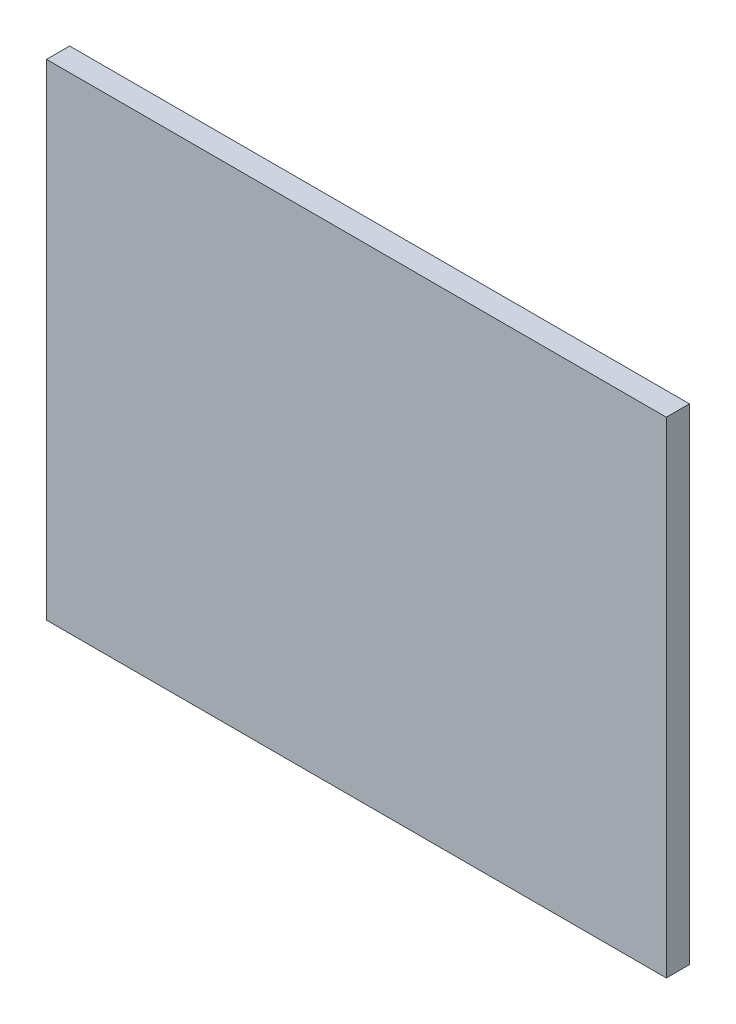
from build123d import *

# Parameters (mm, degrees)
SKETCH1_W      = 85.09
SKETCH1_H      = 66.675
EXTRUDE1_DEPTH = 3.175


with BuildPart() as part:
    # Sketch1 → Extrude1 (new body)
    with BuildSketch(Plane.XY):
        with Locations((0, 33.3375)):
            Rectangle(SKETCH1_W, SKETCH1_H)
    extrude(amount=EXTRUDE1_DEPTH)


solid = part.part
